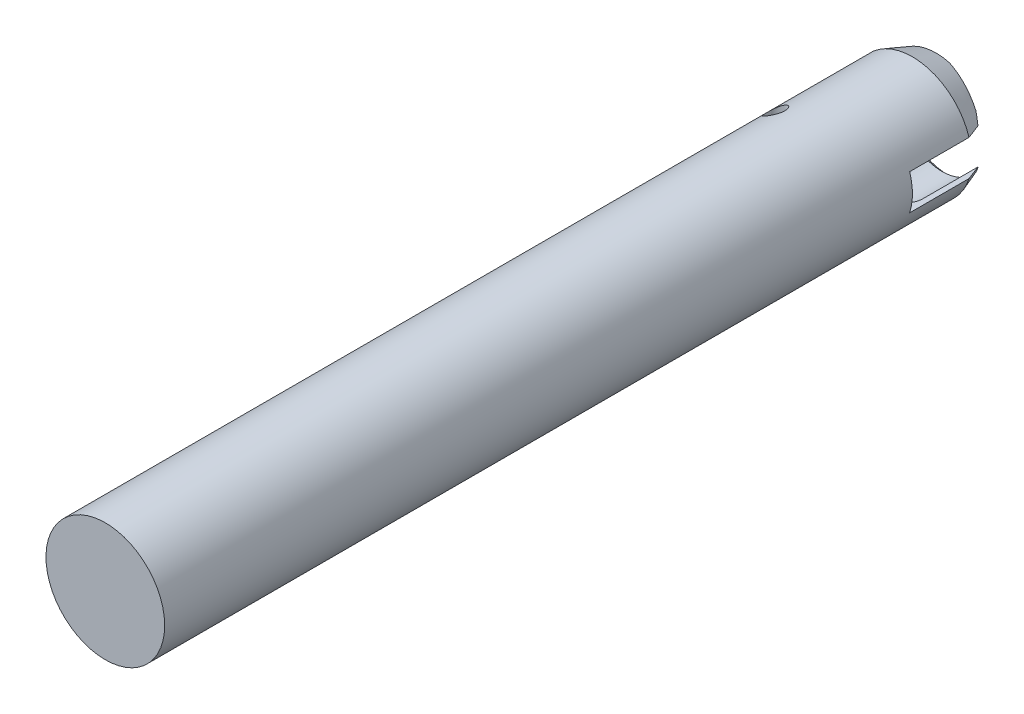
ISO-10303-21;
HEADER;
FILE_DESCRIPTION(('STEP AP214'),'2;1');
FILE_NAME('part.step','',(''),(''),'','','');
FILE_SCHEMA(('AUTOMOTIVE_DESIGN { 1 0 10303 214 1 1 1 1 }'));
ENDSEC;
DATA;
#1=APPLICATION_CONTEXT('core data for automotive mechanical design processes');
#2=APPLICATION_PROTOCOL_DEFINITION('international standard','automotive_design',2000,#1);
#3=PRODUCT_CONTEXT('',#1,'mechanical');
#4=PRODUCT('Part','Part','',(#3));
#5=PRODUCT_RELATED_PRODUCT_CATEGORY('part','',(#4));
#6=PRODUCT_DEFINITION_FORMATION('','',#4);
#7=PRODUCT_DEFINITION_CONTEXT('part definition',#1,'design');
#8=PRODUCT_DEFINITION('design','',#6,#7);
#9=PRODUCT_DEFINITION_SHAPE('','',#8);
#10=(LENGTH_UNIT() NAMED_UNIT(*) SI_UNIT(.MILLI.,.METRE.));
#11=(NAMED_UNIT(*) PLANE_ANGLE_UNIT() SI_UNIT($,.RADIAN.));
#12=(NAMED_UNIT(*) SI_UNIT($,.STERADIAN.) SOLID_ANGLE_UNIT());
#13=UNCERTAINTY_MEASURE_WITH_UNIT(LENGTH_MEASURE(1.E-05),#10,'distance_accuracy_value','');
#14=(GEOMETRIC_REPRESENTATION_CONTEXT(3) GLOBAL_UNCERTAINTY_ASSIGNED_CONTEXT((#13)) GLOBAL_UNIT_ASSIGNED_CONTEXT((#10,
#11,#12)) REPRESENTATION_CONTEXT('',''));
#15=CARTESIAN_POINT('',(0.,0.,0.));
#16=DIRECTION('',(0.,0.,1.));
#17=DIRECTION('',(1.,0.,0.));
#18=AXIS2_PLACEMENT_3D('',#15,#16,#17);
#19=CARTESIAN_POINT('',(0.,0.,35.));
#20=DIRECTION('',(0.,0.,-1.));
#21=DIRECTION('',(-1.,0.,0.));
#22=AXIS2_PLACEMENT_3D('',#19,#20,#21);
#23=CYLINDRICAL_SURFACE('',#22,2.5);
#24=CARTESIAN_POINT('',(-1.27,-2.15339267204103,5.896875));
#25=CARTESIAN_POINT('',(-1.24660588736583,-2.16718982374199,5.89687473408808));
#26=CARTESIAN_POINT('',(-1.22298240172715,-2.180604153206,5.89480587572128));
#27=CARTESIAN_POINT('',(-1.17591569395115,-2.20634101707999,5.88630187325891));
#28=CARTESIAN_POINT('',(-1.15247242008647,-2.21866387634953,5.87986803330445));
#29=CARTESIAN_POINT('',(-1.10643323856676,-2.24198016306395,5.86244258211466));
#30=CARTESIAN_POINT('',(-1.08384289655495,-2.25296564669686,5.85142530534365));
#31=CARTESIAN_POINT('',(-1.04063341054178,-2.27324694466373,5.82487279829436));
#32=CARTESIAN_POINT('',(-1.02001313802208,-2.28254372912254,5.80934017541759));
#33=CARTESIAN_POINT('',(-0.983828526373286,-2.29835389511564,5.7759638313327));
#34=CARTESIAN_POINT('',(-0.96795987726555,-2.30505794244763,5.75854018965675));
#35=CARTESIAN_POINT('',(-0.939371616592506,-2.31685579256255,5.72080271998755));
#36=CARTESIAN_POINT('',(-0.926650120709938,-2.32195055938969,5.70049063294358));
#37=CARTESIAN_POINT('',(-0.905965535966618,-2.33009424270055,5.65958031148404));
#38=CARTESIAN_POINT('',(-0.897675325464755,-2.33328689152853,5.6391754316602));
#39=CARTESIAN_POINT('',(-0.884562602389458,-2.33828971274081,5.59712036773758));
#40=CARTESIAN_POINT('',(-0.879739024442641,-2.34010030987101,5.57547056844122));
#41=CARTESIAN_POINT('',(-0.873899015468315,-2.34228729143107,5.5325797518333));
#42=CARTESIAN_POINT('',(-0.872722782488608,-2.34272388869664,5.51136338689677));
#43=CARTESIAN_POINT('',(-0.873769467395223,-2.34233372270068,5.46902760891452));
#44=CARTESIAN_POINT('',(-0.875991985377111,-2.34150710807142,5.44790818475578));
#45=CARTESIAN_POINT('',(-0.883701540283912,-2.33860813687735,5.40662385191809));
#46=CARTESIAN_POINT('',(-0.889149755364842,-2.33655059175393,5.38645062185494));
#47=CARTESIAN_POINT('',(-0.903068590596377,-2.33120619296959,5.34735084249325));
#48=CARTESIAN_POINT('',(-0.911539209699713,-2.32791933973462,5.32842429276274));
#49=CARTESIAN_POINT('',(-0.931312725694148,-2.32007988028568,5.29207114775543));
#50=CARTESIAN_POINT('',(-0.942651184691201,-2.3155112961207,5.27466738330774));
#51=CARTESIAN_POINT('',(-0.967680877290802,-2.30516305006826,5.24205490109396));
#52=CARTESIAN_POINT('',(-0.981372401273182,-2.29938323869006,5.22684645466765));
#53=CARTESIAN_POINT('',(-1.01123807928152,-2.2864104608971,5.19834533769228));
#54=CARTESIAN_POINT('',(-1.02749161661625,-2.2791688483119,5.18515820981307));
#55=CARTESIAN_POINT('',(-1.06147382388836,-2.26354216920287,5.16169028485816));
#56=CARTESIAN_POINT('',(-1.07920289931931,-2.25515678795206,5.15141029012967));
#57=CARTESIAN_POINT('',(-1.11701109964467,-2.23668541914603,5.1331509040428));
#58=CARTESIAN_POINT('',(-1.13716590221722,-2.22651803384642,5.12541121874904));
#59=CARTESIAN_POINT('',(-1.1779699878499,-2.20520237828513,5.11335609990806));
#60=CARTESIAN_POINT('',(-1.19861948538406,-2.1940536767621,5.10904218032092));
#61=CARTESIAN_POINT('',(-1.2422240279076,-2.16969353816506,5.1034221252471));
#62=CARTESIAN_POINT('',(-1.2651783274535,-2.15639091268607,5.10250687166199));
#63=CARTESIAN_POINT('',(-1.31051937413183,-2.12914071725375,5.1045462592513));
#64=CARTESIAN_POINT('',(-1.33290589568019,-2.11519289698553,5.10750241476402));
#65=CARTESIAN_POINT('',(-1.37927726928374,-2.08529181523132,5.1176433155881));
#66=CARTESIAN_POINT('',(-1.40313540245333,-2.06929738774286,5.12528931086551));
#67=CARTESIAN_POINT('',(-1.44908789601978,-2.03738281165,5.14494656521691));
#68=CARTESIAN_POINT('',(-1.47117969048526,-2.02146280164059,5.15696403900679));
#69=CARTESIAN_POINT('',(-1.51422230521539,-1.98944444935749,5.18602893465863));
#70=CARTESIAN_POINT('',(-1.53503936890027,-1.97338630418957,5.20332093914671));
#71=CARTESIAN_POINT('',(-1.57328389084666,-1.94303125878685,5.24256016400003));
#72=CARTESIAN_POINT('',(-1.59072036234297,-1.92872971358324,5.26449467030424));
#73=CARTESIAN_POINT('',(-1.61556156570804,-1.90791023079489,5.30397745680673));
#74=CARTESIAN_POINT('',(-1.62430319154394,-1.90045829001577,5.32019710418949));
#75=CARTESIAN_POINT('',(-1.6396243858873,-1.88725563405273,5.35427574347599));
#76=CARTESIAN_POINT('',(-1.64620609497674,-1.88150323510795,5.37213308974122));
#77=CARTESIAN_POINT('',(-1.65686419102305,-1.8721252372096,5.40931983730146));
#78=CARTESIAN_POINT('',(-1.66091706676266,-1.86851961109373,5.42866122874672));
#79=CARTESIAN_POINT('',(-1.66608193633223,-1.86391627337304,5.46803517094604));
#80=CARTESIAN_POINT('',(-1.66719668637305,-1.86291611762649,5.48806705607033));
#81=CARTESIAN_POINT('',(-1.66644606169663,-1.8635871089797,5.52525626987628));
#82=CARTESIAN_POINT('',(-1.66496951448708,-1.86490973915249,5.54242998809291));
#83=CARTESIAN_POINT('',(-1.65986660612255,-1.86945296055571,5.57619263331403));
#84=CARTESIAN_POINT('',(-1.65623995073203,-1.87267381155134,5.59278147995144));
#85=CARTESIAN_POINT('',(-1.64706059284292,-1.88075202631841,5.62495997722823));
#86=CARTESIAN_POINT('',(-1.64151053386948,-1.8856071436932,5.64055096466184));
#87=CARTESIAN_POINT('',(-1.62874240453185,-1.89664690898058,5.67052733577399));
#88=CARTESIAN_POINT('',(-1.62152328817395,-1.90283239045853,5.68491195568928));
#89=CARTESIAN_POINT('',(-1.60195644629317,-1.91936605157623,5.71875763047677));
#90=CARTESIAN_POINT('',(-1.58878749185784,-1.9303098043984,5.73745525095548));
#91=CARTESIAN_POINT('',(-1.56002175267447,-1.95363153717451,5.77184855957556));
#92=CARTESIAN_POINT('',(-1.54442086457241,-1.9660119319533,5.78753907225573));
#93=CARTESIAN_POINT('',(-1.51100433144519,-1.99181284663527,5.81609661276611));
#94=CARTESIAN_POINT('',(-1.49315711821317,-2.00524688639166,5.82891420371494));
#95=CARTESIAN_POINT('',(-1.45584112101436,-2.03250117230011,5.8513500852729));
#96=CARTESIAN_POINT('',(-1.43637257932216,-2.04632136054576,5.86096885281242));
#97=CARTESIAN_POINT('',(-1.39322228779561,-2.07598442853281,5.87807352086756));
#98=CARTESIAN_POINT('',(-1.36933855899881,-2.09183057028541,5.88504926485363));
#99=CARTESIAN_POINT('',(-1.32039290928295,-2.12306499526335,5.89445028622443));
#100=CARTESIAN_POINT('',(-1.29533091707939,-2.13845325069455,5.89687528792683));
#101=CARTESIAN_POINT('',(-1.27,-2.15339267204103,5.896875));
#102=B_SPLINE_CURVE_WITH_KNOTS('',3,(#24,#25,#26,#27,#28,#29,#30,#31,#32,#33,#34,#35,#36,#37,
#38,#39,#40,#41,#42,#43,#44,#45,#46,#47,#48,#49,#50,#51,#52,#53,#54,#55,#56,#57,#58,#59,#60,#61,
#62,#63,#64,#65,#66,#67,#68,#69,#70,#71,#72,#73,#74,#75,#76,#77,#78,#79,#80,#81,#82,#83,#84,#85,
#86,#87,#88,#89,#90,#91,#92,#93,#94,#95,#96,#97,#98,#99,#100,#101),.UNSPECIFIED.,.T.,.F.,(4,2,2,
2,2,2,2,2,2,2,2,2,2,2,2,2,2,2,2,2,2,2,2,2,2,2,2,2,2,2,2,2,2,2,2,2,2,2,4),(0.,0.0813907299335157,
0.162757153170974,0.24458546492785,0.326366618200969,0.399470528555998,0.472530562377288,
0.53895846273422,0.605365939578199,0.668819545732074,0.732265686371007,0.794963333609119,
0.857660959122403,0.921177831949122,0.984702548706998,1.05086044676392,1.11703658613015,
1.18833568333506,1.25966627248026,1.33898402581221,1.41833281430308,1.50712208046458,
1.59603807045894,1.68994765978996,1.7836033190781,1.84301527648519,1.90236817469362,
1.96226497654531,2.02210557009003,2.07371503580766,2.12533156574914,2.17687743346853,
2.22845569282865,2.30410248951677,2.37987833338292,2.4568721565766,2.53385449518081,
2.62197824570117,2.7101073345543),.UNSPECIFIED.);
#103=CARTESIAN_POINT('',(-1.27,-2.15339267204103,5.896875));
#104=VERTEX_POINT('',#103);
#105=EDGE_CURVE('E249',#104,#104,#102,.T.);
#106=ORIENTED_EDGE('',*,*,#105,.T.);
#107=EDGE_LOOP('',(#106));
#108=FACE_BOUND('',#107,.T.);
#109=CARTESIAN_POINT('',(-1.27,2.15339267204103,5.896875));
#110=CARTESIAN_POINT('',(-1.29909861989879,2.13622979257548,5.89687417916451));
#111=CARTESIAN_POINT('',(-1.32787722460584,2.11845313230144,5.89367067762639));
#112=CARTESIAN_POINT('',(-1.38382286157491,2.0823423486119,5.88128619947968));
#113=CARTESIAN_POINT('',(-1.41098517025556,2.06400680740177,5.87208855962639));
#114=CARTESIAN_POINT('',(-1.46051575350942,2.02921813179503,5.84912764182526));
#115=CARTESIAN_POINT('',(-1.48309546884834,2.01274420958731,5.83585025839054));
#116=CARTESIAN_POINT('',(-1.52559688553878,1.98072174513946,5.80474832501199));
#117=CARTESIAN_POINT('',(-1.54552365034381,1.96517147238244,5.78693263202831));
#118=CARTESIAN_POINT('',(-1.57716213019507,1.93980865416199,5.75211021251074));
#119=CARTESIAN_POINT('',(-1.58965526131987,1.92956357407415,5.73612614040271));
#120=CARTESIAN_POINT('',(-1.61236425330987,1.9106279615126,5.70178849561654));
#121=CARTESIAN_POINT('',(-1.62258337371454,1.90193520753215,5.68343837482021));
#122=CARTESIAN_POINT('',(-1.63855264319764,1.88818303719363,5.64825129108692));
#123=CARTESIAN_POINT('',(-1.6447819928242,1.88274766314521,5.63178031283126));
#124=CARTESIAN_POINT('',(-1.65507403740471,1.87370680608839,5.59769272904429));
#125=CARTESIAN_POINT('',(-1.65913837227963,1.87009993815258,5.58007700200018));
#126=CARTESIAN_POINT('',(-1.66484754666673,1.8650195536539,5.54404047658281));
#127=CARTESIAN_POINT('',(-1.6664782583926,1.86355849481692,5.52561561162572));
#128=CARTESIAN_POINT('',(-1.6671429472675,1.86296396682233,5.48868279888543));
#129=CARTESIAN_POINT('',(-1.66617754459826,1.86382994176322,5.47017487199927));
#130=CARTESIAN_POINT('',(-1.66193860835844,1.86760987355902,5.43540722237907));
#131=CARTESIAN_POINT('',(-1.65888635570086,1.87032741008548,5.41909767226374));
#132=CARTESIAN_POINT('',(-1.65089566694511,1.87738428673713,5.38731849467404));
#133=CARTESIAN_POINT('',(-1.64595643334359,1.88172431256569,5.37184922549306));
#134=CARTESIAN_POINT('',(-1.63261051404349,1.8933259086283,5.33731910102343));
#135=CARTESIAN_POINT('',(-1.62360205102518,1.90107692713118,5.31865546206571));
#136=CARTESIAN_POINT('',(-1.60324848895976,1.9182732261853,5.28350612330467));
#137=CARTESIAN_POINT('',(-1.59189897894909,1.92772170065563,5.26702463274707));
#138=CARTESIAN_POINT('',(-1.56391171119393,1.95053527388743,5.23213064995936));
#139=CARTESIAN_POINT('',(-1.54667805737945,1.96426281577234,5.21443403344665));
#140=CARTESIAN_POINT('',(-1.50979320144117,1.99275417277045,5.18282514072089));
#141=CARTESIAN_POINT('',(-1.49014042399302,2.00751866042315,5.16891534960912));
#142=CARTESIAN_POINT('',(-1.44865080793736,2.03766442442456,5.14478683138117));
#143=CARTESIAN_POINT('',(-1.42678929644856,2.05305116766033,5.13461747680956));
#144=CARTESIAN_POINT('',(-1.38155433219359,2.08375993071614,5.11836795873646));
#145=CARTESIAN_POINT('',(-1.35818078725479,2.09908194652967,5.11228804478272));
#146=CARTESIAN_POINT('',(-1.30807797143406,2.13070189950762,5.10406456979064));
#147=CARTESIAN_POINT('',(-1.28124307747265,2.14695040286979,5.10235987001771));
#148=CARTESIAN_POINT('',(-1.22712626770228,2.17833377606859,5.10452061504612));
#149=CARTESIAN_POINT('',(-1.19984441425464,2.19346879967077,5.10838528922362));
#150=CARTESIAN_POINT('',(-1.14775725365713,2.22113998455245,5.12153312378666));
#151=CARTESIAN_POINT('',(-1.12291106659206,2.23378345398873,5.13042348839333));
#152=CARTESIAN_POINT('',(-1.0748378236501,2.2573077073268,5.15340387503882));
#153=CARTESIAN_POINT('',(-1.05160900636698,2.26819042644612,5.1674881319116));
#154=CARTESIAN_POINT('',(-1.01087291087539,2.28660676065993,5.19845488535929));
#155=CARTESIAN_POINT('',(-0.99301488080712,2.29439253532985,5.21472667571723));
#156=CARTESIAN_POINT('',(-0.960287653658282,2.30828160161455,5.25064714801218));
#157=CARTESIAN_POINT('',(-0.945416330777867,2.31438609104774,5.27029340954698));
#158=CARTESIAN_POINT('',(-0.920795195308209,2.32428359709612,5.3101177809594));
#159=CARTESIAN_POINT('',(-0.910670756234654,2.32825244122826,5.33002151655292));
#160=CARTESIAN_POINT('',(-0.893857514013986,2.33475921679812,5.37144808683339));
#161=CARTESIAN_POINT('',(-0.887167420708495,2.33729768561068,5.39297031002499));
#162=CARTESIAN_POINT('',(-0.877785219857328,2.34083679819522,5.43573417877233));
#163=CARTESIAN_POINT('',(-0.874892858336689,2.34191457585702,5.45692576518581));
#164=CARTESIAN_POINT('',(-0.872552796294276,2.34278751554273,5.49952343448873));
#165=CARTESIAN_POINT('',(-0.873104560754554,2.34258287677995,5.5209294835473));
#166=CARTESIAN_POINT('',(-0.877587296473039,2.34090706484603,5.56292677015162));
#167=CARTESIAN_POINT('',(-0.881455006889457,2.33945960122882,5.58352575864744));
#168=CARTESIAN_POINT('',(-0.892334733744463,2.33533129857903,5.62374435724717));
#169=CARTESIAN_POINT('',(-0.899346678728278,2.33265048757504,5.64336398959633));
#170=CARTESIAN_POINT('',(-0.916306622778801,2.326040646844,5.68122951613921));
#171=CARTESIAN_POINT('',(-0.926274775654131,2.32210303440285,5.69946486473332));
#172=CARTESIAN_POINT('',(-0.94875276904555,2.31300987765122,5.73395259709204));
#173=CARTESIAN_POINT('',(-0.961262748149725,2.30785426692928,5.75020487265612));
#174=CARTESIAN_POINT('',(-0.988834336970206,2.29617891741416,5.78088276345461));
#175=CARTESIAN_POINT('',(-1.00396759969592,2.28961913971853,5.79522858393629));
#176=CARTESIAN_POINT('',(-1.03594213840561,2.27533083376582,5.82117128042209));
#177=CARTESIAN_POINT('',(-1.05278414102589,2.26760180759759,5.83276697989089));
#178=CARTESIAN_POINT('',(-1.08883486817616,2.2505249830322,5.85377039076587));
#179=CARTESIAN_POINT('',(-1.10812668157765,2.24110260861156,5.86297410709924));
#180=CARTESIAN_POINT('',(-1.14744204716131,2.22122970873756,5.87806429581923));
#181=CARTESIAN_POINT('',(-1.16746524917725,2.21077967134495,5.88395233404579));
#182=CARTESIAN_POINT('',(-1.20131534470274,2.19250667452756,5.89113837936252));
#183=CARTESIAN_POINT('',(-1.21508680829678,2.18490568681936,5.89330072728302));
#184=CARTESIAN_POINT('',(-1.24259571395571,2.16937917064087,5.89616928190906));
#185=CARTESIAN_POINT('',(-1.25633315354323,2.16145361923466,5.89687538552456));
#186=CARTESIAN_POINT('',(-1.27,2.15339267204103,5.896875));
#187=B_SPLINE_CURVE_WITH_KNOTS('',3,(#109,#110,#111,#112,#113,#114,#115,#116,#117,#118,#119,
#120,#121,#122,#123,#124,#125,#126,#127,#128,#129,#130,#131,#132,#133,#134,#135,#136,#137,#138,
#139,#140,#141,#142,#143,#144,#145,#146,#147,#148,#149,#150,#151,#152,#153,#154,#155,#156,#157,
#158,#159,#160,#161,#162,#163,#164,#165,#166,#167,#168,#169,#170,#171,#172,#173,#174,#175,#176,
#177,#178,#179,#180,#181,#182,#183,#184,#185,#186),.UNSPECIFIED.,.T.,.F.,(4,2,2,2,2,2,2,2,2,2,2,
2,2,2,2,2,2,2,2,2,2,2,2,2,2,2,2,2,2,2,2,2,2,2,2,2,2,2,4),(0.,0.101279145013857,
0.202841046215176,0.295254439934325,0.387488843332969,0.455432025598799,0.523277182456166,
0.578343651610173,0.633368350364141,0.68871125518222,0.744040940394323,0.79426334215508,
0.844506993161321,0.910525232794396,0.97666901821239,1.06100687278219,1.14539994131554,
1.23087007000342,1.31634541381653,1.41010901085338,1.50385963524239,1.59113326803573,
1.67831031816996,1.75403445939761,1.82970451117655,1.89739790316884,1.96506584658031,
2.02899955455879,2.09292333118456,2.15565405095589,2.21838334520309,2.28155052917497,
2.34472115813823,2.41001585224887,2.47533843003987,2.54513055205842,2.61488968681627,
2.66245443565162,2.71002255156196),.UNSPECIFIED.);
#188=CARTESIAN_POINT('',(-1.27,2.15339267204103,5.896875));
#189=VERTEX_POINT('',#188);
#190=EDGE_CURVE('E241',#189,#189,#187,.T.);
#191=ORIENTED_EDGE('',*,*,#190,.T.);
#192=EDGE_LOOP('',(#191));
#193=FACE_BOUND('',#192,.T.);
#194=CARTESIAN_POINT('',(0.,0.,35.));
#195=DIRECTION('',(0.,0.,1.));
#196=DIRECTION('',(1.,0.,0.));
#197=AXIS2_PLACEMENT_3D('',#194,#195,#196);
#198=CIRCLE('',#197,2.5);
#199=CARTESIAN_POINT('',(2.5,0.,35.));
#200=VERTEX_POINT('',#199);
#201=EDGE_CURVE('E501',#200,#200,#198,.T.);
#202=ORIENTED_EDGE('',*,*,#201,.F.);
#203=EDGE_LOOP('',(#202));
#204=FACE_BOUND('',#203,.T.);
#205=CARTESIAN_POINT('',(0.,0.,6.5));
#206=DIRECTION('',(0.,0.,1.));
#207=DIRECTION('',(1.,0.,0.));
#208=AXIS2_PLACEMENT_3D('',#205,#206,#207);
#209=CIRCLE('',#208,2.5);
#210=CARTESIAN_POINT('',(-2.43874967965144,-0.55,6.5));
#211=VERTEX_POINT('',#210);
#212=CARTESIAN_POINT('',(-2.26881026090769,-1.05,6.5));
#213=VERTEX_POINT('',#212);
#214=EDGE_CURVE('E229',#211,#213,#209,.T.);
#215=ORIENTED_EDGE('',*,*,#214,.F.);
#216=DIRECTION('',(0.,0.,-1.));
#217=VECTOR('',#216,1.);
#218=CARTESIAN_POINT('',(-2.43874967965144,-0.55,35.));
#219=LINE('',#218,#217);
#220=CARTESIAN_POINT('',(-2.43874967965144,-0.55,1.00000000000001));
#221=VERTEX_POINT('',#220);
#222=EDGE_CURVE('E333',#211,#221,#219,.T.);
#223=ORIENTED_EDGE('',*,*,#222,.T.);
#224=CARTESIAN_POINT('',(0.,0.,1.00000000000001));
#225=DIRECTION('',(0.,0.,1.));
#226=DIRECTION('',(1.,0.,0.));
#227=AXIS2_PLACEMENT_3D('',#224,#225,#226);
#228=CIRCLE('',#227,2.5);
#229=CARTESIAN_POINT('',(2.38484800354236,-0.75,1.00000000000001));
#230=VERTEX_POINT('',#229);
#231=EDGE_CURVE('E425',#221,#230,#228,.T.);
#232=ORIENTED_EDGE('',*,*,#231,.T.);
#233=DIRECTION('',(0.,0.,-1.));
#234=VECTOR('',#233,1.);
#235=CARTESIAN_POINT('',(2.38484800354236,-0.75,35.));
#236=LINE('',#235,#234);
#237=CARTESIAN_POINT('',(2.38484800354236,-0.75,3.5));
#238=VERTEX_POINT('',#237);
#239=EDGE_CURVE('E387',#230,#238,#236,.F.);
#240=ORIENTED_EDGE('',*,*,#239,.T.);
#241=CARTESIAN_POINT('',(0.,0.,3.5));
#242=DIRECTION('',(0.,0.,-1.));
#243=DIRECTION('',(-1.,0.,0.));
#244=AXIS2_PLACEMENT_3D('',#241,#242,#243);
#245=CIRCLE('',#244,2.5);
#246=CARTESIAN_POINT('',(2.38484800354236,0.75,3.5));
#247=VERTEX_POINT('',#246);
#248=EDGE_CURVE('E396',#247,#238,#245,.T.);
#249=ORIENTED_EDGE('',*,*,#248,.F.);
#250=DIRECTION('',(0.,0.,-1.));
#251=VECTOR('',#250,1.);
#252=CARTESIAN_POINT('',(2.38484800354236,0.75,35.));
#253=LINE('',#252,#251);
#254=CARTESIAN_POINT('',(2.38484800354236,0.75,1.00000000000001));
#255=VERTEX_POINT('',#254);
#256=EDGE_CURVE('E393',#247,#255,#253,.T.);
#257=ORIENTED_EDGE('',*,*,#256,.T.);
#258=CARTESIAN_POINT('',(-2.43874967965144,0.55,1.00000000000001));
#259=VERTEX_POINT('',#258);
#260=EDGE_CURVE('E500',#255,#259,#228,.T.);
#261=ORIENTED_EDGE('',*,*,#260,.T.);
#262=DIRECTION('',(0.,0.,-1.));
#263=VECTOR('',#262,1.);
#264=CARTESIAN_POINT('',(-2.43874967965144,0.55,35.));
#265=LINE('',#264,#263);
#266=CARTESIAN_POINT('',(-2.43874967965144,0.55,6.5));
#267=VERTEX_POINT('',#266);
#268=EDGE_CURVE('E332',#259,#267,#265,.F.);
#269=ORIENTED_EDGE('',*,*,#268,.T.);
#270=CARTESIAN_POINT('',(-2.26881026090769,1.05,6.5));
#271=VERTEX_POINT('',#270);
#272=EDGE_CURVE('E232',#271,#267,#209,.T.);
#273=ORIENTED_EDGE('',*,*,#272,.F.);
#274=DIRECTION('',(0.,0.,-1.));
#275=VECTOR('',#274,1.);
#276=CARTESIAN_POINT('',(-2.26881026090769,1.05,35.));
#277=LINE('',#276,#275);
#278=CARTESIAN_POINT('',(-2.26881026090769,1.05,30.));
#279=VERTEX_POINT('',#278);
#280=EDGE_CURVE('E47',#279,#271,#277,.T.);
#281=ORIENTED_EDGE('',*,*,#280,.F.);
#282=CARTESIAN_POINT('',(0.,0.,30.));
#283=DIRECTION('',(0.,0.,-1.));
#284=DIRECTION('',(-1.,0.,0.));
#285=AXIS2_PLACEMENT_3D('',#282,#283,#284);
#286=CIRCLE('',#285,2.5);
#287=CARTESIAN_POINT('',(-2.26881026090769,-1.05,30.));
#288=VERTEX_POINT('',#287);
#289=EDGE_CURVE('E437',#288,#279,#286,.T.);
#290=ORIENTED_EDGE('',*,*,#289,.F.);
#291=DIRECTION('',(0.,0.,-1.));
#292=VECTOR('',#291,1.);
#293=CARTESIAN_POINT('',(-2.26881026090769,-1.05,35.));
#294=LINE('',#293,#292);
#295=EDGE_CURVE('E12',#213,#288,#294,.F.);
#296=ORIENTED_EDGE('',*,*,#295,.F.);
#297=EDGE_LOOP('',(#215,#223,#232,#240,#249,#257,#261,#269,#273,#281,#290,#296));
#298=FACE_BOUND('',#297,.T.);
#299=ADVANCED_FACE('F38',(#108,#193,#204,#298),#23,.T.);
#300=CARTESIAN_POINT('',(-2.72703684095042,0.55,30.));
#301=DIRECTION('',(0.,1.,0.));
#302=DIRECTION('',(0.,0.,1.));
#303=AXIS2_PLACEMENT_3D('',#300,#301,#302);
#304=PLANE('',#303);
#305=DIRECTION('',(1.,0.,0.));
#306=VECTOR('',#305,1.);
#307=CARTESIAN_POINT('',(-2.72703684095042,0.55,6.5));
#308=LINE('',#307,#306);
#309=CARTESIAN_POINT('',(-1.22703684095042,0.55,6.5));
#310=VERTEX_POINT('',#309);
#311=EDGE_CURVE('E231',#267,#310,#308,.T.);
#312=ORIENTED_EDGE('',*,*,#311,.F.);
#313=ORIENTED_EDGE('',*,*,#268,.F.);
#314=CARTESIAN_POINT('',(-3.03990481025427,0.55,2.61897583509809));
#315=CARTESIAN_POINT('',(-2.90897009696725,0.55,2.26509451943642));
#316=CARTESIAN_POINT('',(-2.77786600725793,0.55,1.91127480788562));
#317=CARTESIAN_POINT('',(-2.51493068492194,0.55,1.20391154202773));
#318=CARTESIAN_POINT('',(-2.3830994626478,0.55,0.850367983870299));
#319=CARTESIAN_POINT('',(-2.18451225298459,0.55,0.320364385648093));
#320=CARTESIAN_POINT('',(-2.11817597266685,0.55,0.14374720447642));
#321=CARTESIAN_POINT('',(-1.98512392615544,0.55,-0.209343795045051));
#322=CARTESIAN_POINT('',(-1.91840816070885,0.55,-0.385817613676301));
#323=CARTESIAN_POINT('',(-1.78447266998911,0.55,-0.738577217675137));
#324=CARTESIAN_POINT('',(-1.71725293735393,0.55,-0.91486300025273));
#325=CARTESIAN_POINT('',(-1.58207777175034,0.55,-1.26715346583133));
#326=CARTESIAN_POINT('',(-1.51412233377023,0.55,-1.44315814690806));
#327=CARTESIAN_POINT('',(-1.44568314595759,0.55,-1.61897583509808));
#328=B_SPLINE_CURVE_WITH_KNOTS('',3,(#314,#315,#316,#317,#318,#319,#320,#321,#322,#323,#324,
#325,#326,#327),.UNSPECIFIED.,.F.,.F.,(4,2,2,2,2,2,4),(0.,1.13198346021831,2.263950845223,
2.82994269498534,3.39593343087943,3.96193245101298,4.52793532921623),.UNSPECIFIED.);
#329=CARTESIAN_POINT('',(-2.06400657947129,0.55,0.));
#330=VERTEX_POINT('',#329);
#331=EDGE_CURVE('E325',#259,#330,#328,.T.);
#332=ORIENTED_EDGE('',*,*,#331,.T.);
#333=DIRECTION('',(1.,0.,0.));
#334=VECTOR('',#333,1.);
#335=CARTESIAN_POINT('',(-2.72703684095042,0.55,0.));
#336=LINE('',#335,#334);
#337=CARTESIAN_POINT('',(-1.48781444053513,0.55,0.));
#338=VERTEX_POINT('',#337);
#339=EDGE_CURVE('E400',#330,#338,#336,.T.);
#340=ORIENTED_EDGE('',*,*,#339,.T.);
#341=CARTESIAN_POINT('',(-2.00654879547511,0.55,-0.503681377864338));
#342=CARTESIAN_POINT('',(-1.90077387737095,0.55,-0.400400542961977));
#343=CARTESIAN_POINT('',(-1.79488213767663,0.55,-0.297237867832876));
#344=CARTESIAN_POINT('',(-1.58265170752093,0.55,-0.0913862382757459));
#345=CARTESIAN_POINT('',(-1.47631304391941,0.55,0.0113027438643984));
#346=CARTESIAN_POINT('',(-1.26295758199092,0.55,0.215987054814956));
#347=CARTESIAN_POINT('',(-1.15594074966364,0.55,0.317982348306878));
#348=CARTESIAN_POINT('',(-0.994549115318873,0.55,0.470063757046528));
#349=CARTESIAN_POINT('',(-0.940605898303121,0.55,0.52060711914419));
#350=CARTESIAN_POINT('',(-0.832313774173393,0.55,0.621259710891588));
#351=CARTESIAN_POINT('',(-0.777964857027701,0.55,0.671368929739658));
#352=CARTESIAN_POINT('',(-0.72335546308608,0.55,0.721195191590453));
#353=B_SPLINE_CURVE_WITH_KNOTS('',3,(#341,#342,#343,#344,#345,#346,#347,#348,#349,#350,#351,
#352),.UNSPECIFIED.,.F.,.F.,(4,2,2,2,2,4),(0.,0.443507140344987,0.886987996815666,
1.3304912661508,1.5522560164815,1.77402626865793),.UNSPECIFIED.);
#354=CARTESIAN_POINT('',(-1.22703684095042,0.55,0.249999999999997));
#355=VERTEX_POINT('',#354);
#356=EDGE_CURVE('E316',#338,#355,#353,.T.);
#357=ORIENTED_EDGE('',*,*,#356,.T.);
#358=DIRECTION('',(0.,0.,-1.));
#359=VECTOR('',#358,1.);
#360=CARTESIAN_POINT('',(-1.22703684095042,0.55,30.));
#361=LINE('',#360,#359);
#362=CARTESIAN_POINT('',(-1.22703684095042,0.55,2.70625));
#363=VERTEX_POINT('',#362);
#364=EDGE_CURVE('E406',#363,#355,#361,.T.);
#365=ORIENTED_EDGE('',*,*,#364,.F.);
#366=CARTESIAN_POINT('',(-1.22703684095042,0.55,2.70625));
#367=CARTESIAN_POINT('',(-1.22707931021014,0.55,2.74916532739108));
#368=CARTESIAN_POINT('',(-1.22338704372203,0.55,2.7920624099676));
#369=CARTESIAN_POINT('',(-1.20885505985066,0.55,2.87655311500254));
#370=CARTESIAN_POINT('',(-1.19802797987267,0.55,2.91814890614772));
#371=CARTESIAN_POINT('',(-1.16954343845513,0.55,2.99893830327));
#372=CARTESIAN_POINT('',(-1.15188458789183,0.55,3.03813141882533));
#373=CARTESIAN_POINT('',(-1.11031985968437,0.55,3.11305191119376));
#374=CARTESIAN_POINT('',(-1.08641295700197,0.55,3.14877871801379));
#375=CARTESIAN_POINT('',(-1.03274868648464,0.55,3.21629942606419));
#376=CARTESIAN_POINT('',(-1.00291815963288,0.55,3.24803509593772));
#377=CARTESIAN_POINT('',(-0.938551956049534,0.55,3.30627078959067));
#378=CARTESIAN_POINT('',(-0.904017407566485,0.55,3.3327720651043));
#379=CARTESIAN_POINT('',(-0.829750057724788,0.55,3.38102636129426));
#380=CARTESIAN_POINT('',(-0.789862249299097,0.55,3.4025403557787));
#381=CARTESIAN_POINT('',(-0.707190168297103,0.55,3.43913206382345));
#382=CARTESIAN_POINT('',(-0.664401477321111,0.55,3.45419969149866));
#383=CARTESIAN_POINT('',(-0.573583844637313,0.55,3.47884015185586));
#384=CARTESIAN_POINT('',(-0.525409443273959,0.55,3.48787739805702));
#385=CARTESIAN_POINT('',(-0.4526833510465,0.55,3.4961201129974));
#386=CARTESIAN_POINT('',(-0.4283932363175,0.55,3.4979830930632));
#387=CARTESIAN_POINT('',(-0.379760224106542,0.55,3.5000518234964));
#388=CARTESIAN_POINT('',(-0.355417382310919,0.55,3.50025886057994));
#389=CARTESIAN_POINT('',(-0.331089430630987,0.55,3.49969085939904));
#390=B_SPLINE_CURVE_WITH_KNOTS('',3,(#366,#367,#368,#369,#370,#371,#372,#373,#374,#375,#376,
#377,#378,#379,#380,#381,#382,#383,#384,#385,#386,#387,#388,#389),.UNSPECIFIED.,.F.,.F.,(4,2,2,
2,2,2,2,2,2,2,2,4),(0.,0.128559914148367,0.256892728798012,0.385251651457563,0.513631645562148,
0.643708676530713,0.773754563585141,0.909128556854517,1.04471358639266,1.19113804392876,
1.26417575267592,1.33715670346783),.UNSPECIFIED.);
#391=CARTESIAN_POINT('',(-0.357526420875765,0.55,3.5));
#392=VERTEX_POINT('',#391);
#393=EDGE_CURVE('E292',#363,#392,#390,.T.);
#394=ORIENTED_EDGE('',*,*,#393,.T.);
#395=DIRECTION('',(1.,0.,0.));
#396=VECTOR('',#395,1.);
#397=CARTESIAN_POINT('',(0.5,0.55,3.5));
#398=LINE('',#397,#396);
#399=CARTESIAN_POINT('',(-1.22703684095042,0.55,3.5));
#400=VERTEX_POINT('',#399);
#401=EDGE_CURVE('E54',#400,#392,#398,.T.);
#402=ORIENTED_EDGE('',*,*,#401,.F.);
#403=CARTESIAN_POINT('',(-1.22703684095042,0.55,5.1054573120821));
#404=VERTEX_POINT('',#403);
#405=EDGE_CURVE('E413',#404,#400,#361,.T.);
#406=ORIENTED_EDGE('',*,*,#405,.F.);
#407=CARTESIAN_POINT('',(-1.27,0.55,5.5));
#408=DIRECTION('',(0.,1.,0.));
#409=DIRECTION('',(0.,0.,1.));
#410=AXIS2_PLACEMENT_3D('',#407,#408,#409);
#411=CIRCLE('',#410,0.396875);
#412=CARTESIAN_POINT('',(-1.22703684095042,0.55,5.8945426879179));
#413=VERTEX_POINT('',#412);
#414=EDGE_CURVE('E238',#404,#413,#411,.T.);
#415=ORIENTED_EDGE('',*,*,#414,.T.);
#416=EDGE_CURVE('E412',#310,#413,#361,.T.);
#417=ORIENTED_EDGE('',*,*,#416,.F.);
#418=EDGE_LOOP('',(#312,#313,#332,#340,#357,#365,#394,#402,#406,#415,#417));
#419=FACE_BOUND('',#418,.T.);
#420=ADVANCED_FACE('F304',(#419),#304,.F.);
#421=CARTESIAN_POINT('',(-1.22703684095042,-0.55,30.));
#422=DIRECTION('',(0.,-1.,0.));
#423=DIRECTION('',(0.,0.,-1.));
#424=AXIS2_PLACEMENT_3D('',#421,#422,#423);
#425=PLANE('',#424);
#426=DIRECTION('',(-1.,0.,0.));
#427=VECTOR('',#426,1.);
#428=CARTESIAN_POINT('',(-1.22703684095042,-0.55,6.5));
#429=LINE('',#428,#427);
#430=CARTESIAN_POINT('',(-1.22703684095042,-0.55,6.5));
#431=VERTEX_POINT('',#430);
#432=EDGE_CURVE('E227',#431,#211,#429,.T.);
#433=ORIENTED_EDGE('',*,*,#432,.F.);
#434=DIRECTION('',(0.,0.,-1.));
#435=VECTOR('',#434,1.);
#436=CARTESIAN_POINT('',(-1.22703684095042,-0.55,30.));
#437=LINE('',#436,#435);
#438=CARTESIAN_POINT('',(-1.22703684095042,-0.55,5.8945426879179));
#439=VERTEX_POINT('',#438);
#440=EDGE_CURVE('E407',#431,#439,#437,.T.);
#441=ORIENTED_EDGE('',*,*,#440,.T.);
#442=CARTESIAN_POINT('',(-1.27,-0.55,5.5));
#443=DIRECTION('',(0.,-1.,0.));
#444=DIRECTION('',(0.,0.,-1.));
#445=AXIS2_PLACEMENT_3D('',#442,#443,#444);
#446=CIRCLE('',#445,0.396875);
#447=CARTESIAN_POINT('',(-1.22703684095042,-0.55,5.1054573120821));
#448=VERTEX_POINT('',#447);
#449=EDGE_CURVE('E235',#439,#448,#446,.T.);
#450=ORIENTED_EDGE('',*,*,#449,.T.);
#451=CARTESIAN_POINT('',(-1.22703684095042,-0.55,3.5));
#452=VERTEX_POINT('',#451);
#453=EDGE_CURVE('E410',#448,#452,#437,.T.);
#454=ORIENTED_EDGE('',*,*,#453,.T.);
#455=DIRECTION('',(-1.,0.,0.));
#456=VECTOR('',#455,1.);
#457=CARTESIAN_POINT('',(0.5,-0.55,3.5));
#458=LINE('',#457,#456);
#459=CARTESIAN_POINT('',(-0.357526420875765,-0.55,3.5));
#460=VERTEX_POINT('',#459);
#461=EDGE_CURVE('E449',#460,#452,#458,.T.);
#462=ORIENTED_EDGE('',*,*,#461,.F.);
#463=CARTESIAN_POINT('',(-1.22703684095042,-0.55,2.70625));
#464=CARTESIAN_POINT('',(-1.22707931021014,-0.55,2.74916532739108));
#465=CARTESIAN_POINT('',(-1.22338704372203,-0.55,2.7920624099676));
#466=CARTESIAN_POINT('',(-1.20885505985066,-0.55,2.87655311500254));
#467=CARTESIAN_POINT('',(-1.19802797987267,-0.55,2.91814890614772));
#468=CARTESIAN_POINT('',(-1.16954343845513,-0.55,2.99893830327));
#469=CARTESIAN_POINT('',(-1.15188458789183,-0.55,3.03813141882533));
#470=CARTESIAN_POINT('',(-1.11031985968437,-0.55,3.11305191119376));
#471=CARTESIAN_POINT('',(-1.08641295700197,-0.55,3.14877871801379));
#472=CARTESIAN_POINT('',(-1.03274868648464,-0.55,3.21629942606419));
#473=CARTESIAN_POINT('',(-1.00291815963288,-0.55,3.24803509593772));
#474=CARTESIAN_POINT('',(-0.938551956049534,-0.55,3.30627078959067));
#475=CARTESIAN_POINT('',(-0.904017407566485,-0.55,3.33277206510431));
#476=CARTESIAN_POINT('',(-0.829750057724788,-0.55,3.38102636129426));
#477=CARTESIAN_POINT('',(-0.789862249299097,-0.55,3.4025403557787));
#478=CARTESIAN_POINT('',(-0.707190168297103,-0.55,3.43913206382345));
#479=CARTESIAN_POINT('',(-0.664401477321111,-0.55,3.45419969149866));
#480=CARTESIAN_POINT('',(-0.573583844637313,-0.55,3.47884015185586));
#481=CARTESIAN_POINT('',(-0.525409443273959,-0.55,3.48787739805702));
#482=CARTESIAN_POINT('',(-0.4526833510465,-0.55,3.4961201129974));
#483=CARTESIAN_POINT('',(-0.4283932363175,-0.55,3.4979830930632));
#484=CARTESIAN_POINT('',(-0.379760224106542,-0.55,3.5000518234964));
#485=CARTESIAN_POINT('',(-0.355417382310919,-0.55,3.50025886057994));
#486=CARTESIAN_POINT('',(-0.331089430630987,-0.55,3.49969085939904));
#487=B_SPLINE_CURVE_WITH_KNOTS('',3,(#463,#464,#465,#466,#467,#468,#469,#470,#471,#472,#473,
#474,#475,#476,#477,#478,#479,#480,#481,#482,#483,#484,#485,#486),.UNSPECIFIED.,.F.,.F.,(4,2,2,
2,2,2,2,2,2,2,2,4),(0.,0.128559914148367,0.256892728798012,0.385251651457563,0.513631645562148,
0.643708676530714,0.773754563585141,0.909128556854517,1.04471358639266,1.19113804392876,
1.26417575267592,1.33715670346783),.UNSPECIFIED.);
#488=CARTESIAN_POINT('',(-1.22703684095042,-0.55,2.70625));
#489=VERTEX_POINT('',#488);
#490=EDGE_CURVE('E453',#460,#489,#487,.F.);
#491=ORIENTED_EDGE('',*,*,#490,.T.);
#492=CARTESIAN_POINT('',(-1.22703684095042,-0.55,0.249999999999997));
#493=VERTEX_POINT('',#492);
#494=EDGE_CURVE('E411',#489,#493,#437,.T.);
#495=ORIENTED_EDGE('',*,*,#494,.T.);
#496=CARTESIAN_POINT('',(-0.72335546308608,-0.55,0.721195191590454));
#497=CARTESIAN_POINT('',(-0.77174401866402,-0.55,0.677049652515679));
#498=CARTESIAN_POINT('',(-0.819925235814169,-0.55,0.632678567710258));
#499=CARTESIAN_POINT('',(-0.91595822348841,-0.55,0.543583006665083));
#500=CARTESIAN_POINT('',(-0.963810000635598,-0.55,0.498858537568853));
#501=CARTESIAN_POINT('',(-1.10699758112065,-0.55,0.364302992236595));
#502=CARTESIAN_POINT('',(-1.20197002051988,-0.55,0.274085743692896));
#503=CARTESIAN_POINT('',(-1.39131038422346,-0.55,0.0930339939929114));
#504=CARTESIAN_POINT('',(-1.48567834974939,-0.55,0.00219953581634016));
#505=CARTESIAN_POINT('',(-1.67401758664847,-0.55,-0.179881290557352));
#506=CARTESIAN_POINT('',(-1.76798885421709,-0.55,-0.271127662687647));
#507=CARTESIAN_POINT('',(-1.88596026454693,-0.55,-0.386025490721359));
#508=CARTESIAN_POINT('',(-1.91008961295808,-0.55,-0.409544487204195));
#509=CARTESIAN_POINT('',(-1.9583315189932,-0.55,-0.456600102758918));
#510=CARTESIAN_POINT('',(-1.98244407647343,-0.55,-0.480136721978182));
#511=CARTESIAN_POINT('',(-2.00654879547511,-0.55,-0.503681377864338));
#512=B_SPLINE_CURVE_WITH_KNOTS('',3,(#496,#497,#498,#499,#500,#501,#502,#503,#504,#505,#506,
#507,#508,#509,#510,#511),.UNSPECIFIED.,.F.,.F.,(4,2,2,2,2,2,2,4),(0.,0.196498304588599,
0.392992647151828,0.785963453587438,1.17890717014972,1.5718546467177,1.67294034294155,
1.774026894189),.UNSPECIFIED.);
#513=CARTESIAN_POINT('',(-1.48781444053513,-0.55,0.));
#514=VERTEX_POINT('',#513);
#515=EDGE_CURVE('E465',#493,#514,#512,.T.);
#516=ORIENTED_EDGE('',*,*,#515,.T.);
#517=DIRECTION('',(-1.,0.,0.));
#518=VECTOR('',#517,1.);
#519=CARTESIAN_POINT('',(-1.22703684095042,-0.55,0.));
#520=LINE('',#519,#518);
#521=CARTESIAN_POINT('',(-2.06400657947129,-0.55,0.));
#522=VERTEX_POINT('',#521);
#523=EDGE_CURVE('E404',#514,#522,#520,.T.);
#524=ORIENTED_EDGE('',*,*,#523,.T.);
#525=CARTESIAN_POINT('',(-1.44568314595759,-0.55,-1.61897583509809));
#526=CARTESIAN_POINT('',(-1.5153679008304,-0.55,-1.43995503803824));
#527=CARTESIAN_POINT('',(-1.58455256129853,-0.55,-1.26074096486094));
#528=CARTESIAN_POINT('',(-1.72216376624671,-0.55,-0.902023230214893));
#529=CARTESIAN_POINT('',(-1.79059031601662,-0.55,-0.722519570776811));
#530=CARTESIAN_POINT('',(-1.9269273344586,-0.55,-0.363319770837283));
#531=CARTESIAN_POINT('',(-1.9948378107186,-0.55,-0.18362363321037));
#532=CARTESIAN_POINT('',(-2.13027160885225,-0.55,0.175914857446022));
#533=CARTESIAN_POINT('',(-2.19779492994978,-0.55,0.3557572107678));
#534=CARTESIAN_POINT('',(-2.39511387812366,-0.55,0.882566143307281));
#535=CARTESIAN_POINT('',(-2.52452212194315,-0.55,1.22967771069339));
#536=CARTESIAN_POINT('',(-2.78264402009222,-0.55,1.92416458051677));
#537=CARTESIAN_POINT('',(-2.91135766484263,-0.55,2.27153988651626));
#538=CARTESIAN_POINT('',(-3.03990481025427,-0.55,2.61897583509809));
#539=B_SPLINE_CURVE_WITH_KNOTS('',3,(#525,#526,#527,#528,#529,#530,#531,#532,#533,#534,#535,
#536,#537,#538),.UNSPECIFIED.,.F.,.F.,(4,2,2,2,2,2,4),(0.,0.576313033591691,1.15262204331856,
1.72892256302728,2.30522423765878,3.41657213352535,4.52793531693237),.UNSPECIFIED.);
#540=EDGE_CURVE('E372',#522,#221,#539,.T.);
#541=ORIENTED_EDGE('',*,*,#540,.T.);
#542=ORIENTED_EDGE('',*,*,#222,.F.);
#543=EDGE_LOOP('',(#433,#441,#450,#454,#462,#491,#495,#516,#524,#541,#542));
#544=FACE_BOUND('',#543,.T.);
#545=ADVANCED_FACE('F309',(#544),#425,.F.);
#546=CARTESIAN_POINT('',(-1.22703684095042,0.55,30.));
#547=DIRECTION('',(1.,0.,0.));
#548=DIRECTION('',(0.,0.,-1.));
#549=AXIS2_PLACEMENT_3D('',#546,#547,#548);
#550=PLANE('',#549);
#551=ORIENTED_EDGE('',*,*,#453,.F.);
#552=DIRECTION('',(0.,1.,0.));
#553=VECTOR('',#552,1.);
#554=CARTESIAN_POINT('',(-1.22703684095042,-2.5,5.1054573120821));
#555=LINE('',#554,#553);
#556=EDGE_CURVE('E436',#448,#404,#555,.T.);
#557=ORIENTED_EDGE('',*,*,#556,.T.);
#558=ORIENTED_EDGE('',*,*,#405,.T.);
#559=DIRECTION('',(0.,-1.,0.));
#560=VECTOR('',#559,1.);
#561=CARTESIAN_POINT('',(-1.22703684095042,0.,3.5));
#562=LINE('',#561,#560);
#563=EDGE_CURVE('E409',#400,#452,#562,.T.);
#564=ORIENTED_EDGE('',*,*,#563,.T.);
#565=EDGE_LOOP('',(#551,#557,#558,#564));
#566=FACE_BOUND('',#565,.T.);
#567=ADVANCED_FACE('F461',(#566),#550,.F.);
#568=CARTESIAN_POINT('',(0.,0.,1.00000000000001));
#569=DIRECTION('',(0.,0.,1.));
#570=DIRECTION('',(1.,0.,0.));
#571=AXIS2_PLACEMENT_3D('',#568,#569,#570);
#572=CONICAL_SURFACE('',#571,2.5,0.349065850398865);
#573=CARTESIAN_POINT('',(1.39776446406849,0.75,-1.51045861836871));
#574=CARTESIAN_POINT('',(1.43537183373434,0.75,-1.41939849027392));
#575=CARTESIAN_POINT('',(1.47269901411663,0.75,-1.32822334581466));
#576=CARTESIAN_POINT('',(1.54688620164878,0.75,-1.14568400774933));
#577=CARTESIAN_POINT('',(1.58374621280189,0.75,-1.05431981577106));
#578=CARTESIAN_POINT('',(1.69376429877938,0.75,-0.78000767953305));
#579=CARTESIAN_POINT('',(1.76636242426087,0.75,-0.596835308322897));
#580=CARTESIAN_POINT('',(1.91052284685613,0.75,-0.23009606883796));
#581=CARTESIAN_POINT('',(1.98208520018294,0.75,-0.0465292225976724));
#582=CARTESIAN_POINT('',(2.12445788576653,0.75,0.320897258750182));
#583=CARTESIAN_POINT('',(2.19526821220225,0.75,0.504756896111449));
#584=CARTESIAN_POINT('',(2.38203659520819,0.75,0.99188683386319));
#585=CARTESIAN_POINT('',(2.49751965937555,0.75,1.29533903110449));
#586=CARTESIAN_POINT('',(2.72746200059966,0.75,1.9026463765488));
#587=CARTESIAN_POINT('',(2.84192123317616,0.75,2.20650154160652));
#588=CARTESIAN_POINT('',(2.9561035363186,0.75,2.5104586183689));
#589=B_SPLINE_CURVE_WITH_KNOTS('',3,(#573,#574,#575,#576,#577,#578,#579,#580,#581,#582,#583,
#584,#585,#586,#587,#588),.UNSPECIFIED.,.F.,.F.,(4,2,2,2,2,2,2,4),(0.,0.295559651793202,
0.591116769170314,1.18221522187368,1.77328147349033,2.36435229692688,3.3384012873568,
4.31249239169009),.UNSPECIFIED.);
#590=CARTESIAN_POINT('',(2.15004734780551,0.75,0.387598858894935));
#591=VERTEX_POINT('',#590);
#592=EDGE_CURVE('E277',#591,#255,#589,.T.);
#593=ORIENTED_EDGE('',*,*,#592,.F.);
#594=CARTESIAN_POINT('',(1.2039302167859,1.67022109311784,-0.211900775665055));
#595=CARTESIAN_POINT('',(1.25949748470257,1.64680080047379,-0.174822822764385));
#596=CARTESIAN_POINT('',(1.31437113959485,1.62040693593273,-0.138577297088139));
#597=CARTESIAN_POINT('',(1.42232761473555,1.56149540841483,-0.0679045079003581));
#598=CARTESIAN_POINT('',(1.47540251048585,1.52895398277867,-0.0334849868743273));
#599=CARTESIAN_POINT('',(1.60691386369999,1.43849101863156,0.0510959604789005));
#600=CARTESIAN_POINT('',(1.68353325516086,1.37636421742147,0.0996973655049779));
#601=CARTESIAN_POINT('',(1.82754847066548,1.23803697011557,0.190086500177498));
#602=CARTESIAN_POINT('',(1.8949476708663,1.16184169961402,0.231876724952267));
#603=CARTESIAN_POINT('',(2.01790058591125,0.995921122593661,0.307479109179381));
#604=CARTESIAN_POINT('',(2.07337073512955,0.906107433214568,0.341235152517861));
#605=CARTESIAN_POINT('',(2.16864082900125,0.715615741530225,0.398872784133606));
#606=CARTESIAN_POINT('',(2.20845193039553,0.614945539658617,0.422761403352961));
#607=CARTESIAN_POINT('',(2.26597628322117,0.419050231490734,0.457170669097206));
#608=CARTESIAN_POINT('',(2.28579754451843,0.324666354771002,0.468969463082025));
#609=CARTESIAN_POINT('',(2.31016007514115,0.133278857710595,0.483462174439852));
#610=CARTESIAN_POINT('',(2.31471065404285,0.0362768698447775,0.48616163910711));
#611=CARTESIAN_POINT('',(2.30854756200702,-0.148917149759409,0.482499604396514));
#612=CARTESIAN_POINT('',(2.29907583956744,-0.237168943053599,0.476875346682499));
#613=CARTESIAN_POINT('',(2.26758618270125,-0.410555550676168,0.458117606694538));
#614=CARTESIAN_POINT('',(2.24557020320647,-0.495690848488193,0.444985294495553));
#615=CARTESIAN_POINT('',(2.18995008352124,-0.660953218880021,0.411647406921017));
#616=CARTESIAN_POINT('',(2.15630316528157,-0.741060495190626,0.391415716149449));
#617=CARTESIAN_POINT('',(2.07888871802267,-0.894224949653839,0.34456577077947));
#618=CARTESIAN_POINT('',(2.03511468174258,-0.967277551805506,0.317943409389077));
#619=CARTESIAN_POINT('',(1.93528975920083,-1.11055010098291,0.256751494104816));
#620=CARTESIAN_POINT('',(1.87853860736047,-1.18008063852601,0.221717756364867));
#621=CARTESIAN_POINT('',(1.75735221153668,-1.30843390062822,0.146146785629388));
#622=CARTESIAN_POINT('',(1.69292697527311,-1.36727032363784,0.10561671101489));
#623=CARTESIAN_POINT('',(1.59346438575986,-1.44609441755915,0.0423282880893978));
#624=CARTESIAN_POINT('',(1.56059941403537,-1.47035415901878,0.0213096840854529));
#625=CARTESIAN_POINT('',(1.42873573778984,-1.56104081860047,-0.0635004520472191));
#626=CARTESIAN_POINT('',(1.32530534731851,-1.61781816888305,-0.131053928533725));
#627=CARTESIAN_POINT('',(1.11312679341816,-1.70957391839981,-0.272367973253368));
#628=CARTESIAN_POINT('',(1.00437074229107,-1.74451886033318,-0.346137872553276));
#629=CARTESIAN_POINT('',(0.86417566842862,-1.77581636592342,-0.44328243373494));
#630=CARTESIAN_POINT('',(0.833395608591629,-1.78184765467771,-0.464735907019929));
#631=CARTESIAN_POINT('',(0.802600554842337,-1.78706159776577,-0.486332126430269));
#632=B_SPLINE_CURVE_WITH_KNOTS('',3,(#594,#595,#596,#597,#598,#599,#600,#601,#602,#603,#604,
#605,#606,#607,#608,#609,#610,#611,#612,#613,#614,#615,#616,#617,#618,#619,#620,#621,#622,#623,
#624,#625,#626,#627,#628,#629,#630,#631),.UNSPECIFIED.,.F.,.F.,(4,2,2,2,2,2,2,2,2,2,2,2,2,2,2,2,
2,2,4),(0.,0.212285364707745,0.425408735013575,0.753856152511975,1.08218297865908,
1.41273984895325,1.74306077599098,2.03295915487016,2.32268076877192,2.58822837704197,
2.85373461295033,3.12022794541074,3.38689299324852,3.67480406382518,3.9623436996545,
4.10010705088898,4.5055282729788,4.91156927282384,5.02552683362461),.UNSPECIFIED.);
#633=CARTESIAN_POINT('',(1.92447218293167,1.1207297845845,0.249999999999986));
#634=VERTEX_POINT('',#633);
#635=EDGE_CURVE('E348',#634,#591,#632,.T.);
#636=ORIENTED_EDGE('',*,*,#635,.F.);
#637=CARTESIAN_POINT('',(1.92447218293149,1.12072978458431,0.249999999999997));
#638=CARTESIAN_POINT('',(1.89273060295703,1.17085814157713,0.243949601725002));
#639=CARTESIAN_POINT('',(1.85890529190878,1.21958430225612,0.237520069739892));
#640=CARTESIAN_POINT('',(1.78733002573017,1.31394987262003,0.223962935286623));
#641=CARTESIAN_POINT('',(1.74958059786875,1.35958969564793,0.216835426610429));
#642=CARTESIAN_POINT('',(1.63088926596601,1.49137302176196,0.194511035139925));
#643=CARTESIAN_POINT('',(1.54442891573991,1.57249895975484,0.178357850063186));
#644=CARTESIAN_POINT('',(1.35924200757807,1.71925306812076,0.144064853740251));
#645=CARTESIAN_POINT('',(1.26047888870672,1.78483327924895,0.125919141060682));
#646=CARTESIAN_POINT('',(1.05370445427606,1.89854233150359,0.0882838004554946));
#647=CARTESIAN_POINT('',(0.945706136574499,1.94669521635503,0.0687960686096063));
#648=CARTESIAN_POINT('',(0.789532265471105,2.0013345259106,0.0408824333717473));
#649=CARTESIAN_POINT('',(0.743898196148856,2.01558744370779,0.0327565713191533));
#650=CARTESIAN_POINT('',(0.651860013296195,2.04096678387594,0.016429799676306));
#651=CARTESIAN_POINT('',(0.605457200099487,2.05209800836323,0.00822902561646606));
#652=CARTESIAN_POINT('',(0.558716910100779,2.06166403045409,0.));
#653=B_SPLINE_CURVE_WITH_KNOTS('',3,(#637,#638,#639,#640,#641,#642,#643,#644,#645,#646,#647,
#648,#649,#650,#651,#652),.UNSPECIFIED.,.F.,.F.,(4,2,2,2,2,2,2,4),(0.,0.178807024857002,
0.357590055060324,0.714737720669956,1.07297326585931,1.43071266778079,1.57610901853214,
1.72128046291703),.UNSPECIFIED.);
#654=CARTESIAN_POINT('',(0.558716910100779,2.06166403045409,0.));
#655=VERTEX_POINT('',#654);
#656=EDGE_CURVE('E365',#634,#655,#653,.T.);
#657=ORIENTED_EDGE('',*,*,#656,.T.);
#658=CARTESIAN_POINT('',(0.,0.,0.));
#659=DIRECTION('',(0.,0.,1.));
#660=DIRECTION('',(1.,0.,0.));
#661=AXIS2_PLACEMENT_3D('',#658,#659,#660);
#662=CIRCLE('',#661,2.1360297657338);
#663=EDGE_CURVE('E498',#330,#655,#662,.F.);
#664=ORIENTED_EDGE('',*,*,#663,.F.);
#665=ORIENTED_EDGE('',*,*,#331,.F.);
#666=ORIENTED_EDGE('',*,*,#260,.F.);
#667=EDGE_LOOP('',(#593,#636,#657,#664,#665,#666));
#668=FACE_BOUND('',#667,.T.);
#669=ADVANCED_FACE('F342',(#668),#572,.T.);
#670=CARTESIAN_POINT('',(0.5,0.,3.5));
#671=DIRECTION('',(0.,0.,-1.));
#672=DIRECTION('',(-1.,0.,0.));
#673=AXIS2_PLACEMENT_3D('',#670,#671,#672);
#674=CYLINDRICAL_SURFACE('',#673,1.8125);
#675=DIRECTION('',(0.,0.,-1.));
#676=VECTOR('',#675,1.);
#677=CARTESIAN_POINT('',(2.15004734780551,0.75,3.5));
#678=LINE('',#677,#676);
#679=CARTESIAN_POINT('',(2.15004734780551,0.75,2.70625));
#680=VERTEX_POINT('',#679);
#681=EDGE_CURVE('E391',#591,#680,#678,.F.);
#682=ORIENTED_EDGE('',*,*,#681,.T.);
#683=CARTESIAN_POINT('',(0.5,0.,2.70625));
#684=DIRECTION('',(0.,0.,-1.));
#685=DIRECTION('',(-1.,0.,0.));
#686=AXIS2_PLACEMENT_3D('',#683,#684,#685);
#687=CIRCLE('',#686,1.8125);
#688=EDGE_CURVE('E62',#680,#363,#687,.F.);
#689=ORIENTED_EDGE('',*,*,#688,.T.);
#690=ORIENTED_EDGE('',*,*,#364,.T.);
#691=CARTESIAN_POINT('',(0.5,0.,0.249999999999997));
#692=DIRECTION('',(0.,0.,1.));
#693=DIRECTION('',(1.,0.,0.));
#694=AXIS2_PLACEMENT_3D('',#691,#692,#693);
#695=CIRCLE('',#694,1.8125);
#696=EDGE_CURVE('E492',#355,#634,#695,.F.);
#697=ORIENTED_EDGE('',*,*,#696,.T.);
#698=ORIENTED_EDGE('',*,*,#635,.T.);
#699=EDGE_LOOP('',(#682,#689,#690,#697,#698));
#700=FACE_BOUND('',#699,.T.);
#701=ADVANCED_FACE('F521',(#700),#674,.F.);
#702=CARTESIAN_POINT('',(0.,0.,0.));
#703=DIRECTION('',(0.,0.,1.));
#704=DIRECTION('',(1.,0.,0.));
#705=AXIS2_PLACEMENT_3D('',#702,#703,#704);
#706=PLANE('',#705);
#707=CARTESIAN_POINT('',(0.5,0.,0.));
#708=DIRECTION('',(0.,0.,1.));
#709=DIRECTION('',(1.,0.,0.));
#710=AXIS2_PLACEMENT_3D('',#707,#708,#709);
#711=CIRCLE('',#710,2.0625);
#712=EDGE_CURVE('E470',#655,#338,#711,.T.);
#713=ORIENTED_EDGE('',*,*,#712,.T.);
#714=ORIENTED_EDGE('',*,*,#339,.F.);
#715=ORIENTED_EDGE('',*,*,#663,.T.);
#716=EDGE_LOOP('',(#713,#714,#715));
#717=FACE_BOUND('',#716,.T.);
#718=ADVANCED_FACE('F509',(#717),#706,.F.);
#719=CARTESIAN_POINT('',(0.5,0.,0.249999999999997));
#720=DIRECTION('',(0.,0.,-1.));
#721=DIRECTION('',(-1.,0.,0.));
#722=AXIS2_PLACEMENT_3D('',#719,#720,#721);
#723=CONICAL_SURFACE('',#722,1.8125,0.78539816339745);
#724=ORIENTED_EDGE('',*,*,#356,.F.);
#725=ORIENTED_EDGE('',*,*,#712,.F.);
#726=ORIENTED_EDGE('',*,*,#656,.F.);
#727=ORIENTED_EDGE('',*,*,#696,.F.);
#728=EDGE_LOOP('',(#724,#725,#726,#727));
#729=FACE_BOUND('',#728,.T.);
#730=ADVANCED_FACE('F513',(#729),#723,.F.);
#731=CARTESIAN_POINT('',(0.,0.,35.));
#732=DIRECTION('',(0.,0.,1.));
#733=DIRECTION('',(1.,0.,0.));
#734=AXIS2_PLACEMENT_3D('',#731,#732,#733);
#735=PLANE('',#734);
#736=ORIENTED_EDGE('',*,*,#201,.T.);
#737=EDGE_LOOP('',(#736));
#738=FACE_BOUND('',#737,.T.);
#739=ADVANCED_FACE('F515',(#738),#735,.T.);
#740=CARTESIAN_POINT('',(0.558716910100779,-2.06166403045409,0.));
#741=VERTEX_POINT('',#740);
#742=EDGE_CURVE('E497',#741,#522,#662,.F.);
#743=ORIENTED_EDGE('',*,*,#742,.T.);
#744=ORIENTED_EDGE('',*,*,#523,.F.);
#745=EDGE_CURVE('E472',#514,#741,#711,.T.);
#746=ORIENTED_EDGE('',*,*,#745,.T.);
#747=EDGE_LOOP('',(#743,#744,#746));
#748=FACE_BOUND('',#747,.T.);
#749=ADVANCED_FACE('F340',(#748),#706,.F.);
#750=CARTESIAN_POINT('',(2.9561035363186,-0.75,2.5104586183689));
#751=CARTESIAN_POINT('',(2.89293641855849,-0.75,2.34224063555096));
#752=CARTESIAN_POINT('',(2.82966433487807,-0.75,2.17406215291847));
#753=CARTESIAN_POINT('',(2.70285736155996,-0.75,1.83780365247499));
#754=CARTESIAN_POINT('',(2.6393224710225,-0.75,1.66972363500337));
#755=CARTESIAN_POINT('',(2.44825172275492,-0.75,1.165680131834));
#756=CARTESIAN_POINT('',(2.3202430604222,-0.75,0.829895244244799));
#757=CARTESIAN_POINT('',(2.12669686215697,-0.75,0.326797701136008));
#758=CARTESIAN_POINT('',(2.06192427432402,-0.75,0.159190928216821));
#759=CARTESIAN_POINT('',(1.93169736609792,-0.75,-0.175756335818));
#760=CARTESIAN_POINT('',(1.86624305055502,-0.75,-0.343096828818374));
#761=CARTESIAN_POINT('',(1.73442614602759,-0.75,-0.677431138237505));
#762=CARTESIAN_POINT('',(1.66806350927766,-0.75,-0.844424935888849));
#763=CARTESIAN_POINT('',(1.53401261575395,-0.75,-1.17788374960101));
#764=CARTESIAN_POINT('',(1.46632432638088,-0.75,-1.34434875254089));
#765=CARTESIAN_POINT('',(1.39776446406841,-0.75,-1.51045861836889));
#766=B_SPLINE_CURVE_WITH_KNOTS('',3,(#750,#751,#752,#753,#754,#755,#756,#757,#758,#759,#760,
#761,#762,#763,#764,#765),.UNSPECIFIED.,.F.,.F.,(4,2,2,2,2,2,2,4),(0.,0.539060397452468,
1.07812264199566,2.15618961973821,2.69525032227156,3.23430719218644,3.77339251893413,
4.31249111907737),.UNSPECIFIED.);
#767=CARTESIAN_POINT('',(2.15004734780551,-0.75,0.387598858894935));
#768=VERTEX_POINT('',#767);
#769=EDGE_CURVE('E379',#230,#768,#766,.T.);
#770=ORIENTED_EDGE('',*,*,#769,.F.);
#771=ORIENTED_EDGE('',*,*,#231,.F.);
#772=ORIENTED_EDGE('',*,*,#540,.F.);
#773=ORIENTED_EDGE('',*,*,#742,.F.);
#774=CARTESIAN_POINT('',(0.558716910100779,-2.06166403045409,0.));
#775=CARTESIAN_POINT('',(0.657128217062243,-2.04156737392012,0.0173225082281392));
#776=CARTESIAN_POINT('',(0.75409421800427,-2.01442956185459,0.0345354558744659));
#777=CARTESIAN_POINT('',(0.943508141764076,-1.94665720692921,0.0684181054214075));
#778=CARTESIAN_POINT('',(1.0359469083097,-1.90599651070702,0.085086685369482));
#779=CARTESIAN_POINT('',(1.23242303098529,-1.80226982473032,0.120782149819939));
#780=CARTESIAN_POINT('',(1.33499389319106,-1.7363284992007,0.139598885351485));
#781=CARTESIAN_POINT('',(1.52742623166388,-1.58769047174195,0.175189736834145));
#782=CARTESIAN_POINT('',(1.61730506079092,-1.50501703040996,0.191966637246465));
#783=CARTESIAN_POINT('',(1.74114248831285,-1.36955942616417,0.215243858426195));
#784=CARTESIAN_POINT('',(1.78085325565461,-1.32208857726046,0.222738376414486));
#785=CARTESIAN_POINT('',(1.85595370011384,-1.2238281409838,0.236959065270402));
#786=CARTESIAN_POINT('',(1.89134849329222,-1.17304259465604,0.243686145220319));
#787=CARTESIAN_POINT('',(1.92447218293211,-1.12072978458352,0.249999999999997));
#788=B_SPLINE_CURVE_WITH_KNOTS('',3,(#774,#775,#776,#777,#778,#779,#780,#781,#782,#783,#784,
#785,#786,#787),.UNSPECIFIED.,.F.,.F.,(4,2,2,2,2,2,4),(0.,0.305481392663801,0.611557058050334,
0.979903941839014,1.34774223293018,1.53455709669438,1.72114831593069),.UNSPECIFIED.);
#789=CARTESIAN_POINT('',(1.92447218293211,-1.12072978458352,0.249999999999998));
#790=VERTEX_POINT('',#789);
#791=EDGE_CURVE('E358',#741,#790,#788,.T.);
#792=ORIENTED_EDGE('',*,*,#791,.T.);
#793=EDGE_CURVE('E496',#768,#790,#632,.T.);
#794=ORIENTED_EDGE('',*,*,#793,.F.);
#795=EDGE_LOOP('',(#770,#771,#772,#773,#792,#794));
#796=FACE_BOUND('',#795,.T.);
#797=ADVANCED_FACE('F336',(#796),#572,.T.);
#798=ORIENTED_EDGE('',*,*,#494,.F.);
#799=CARTESIAN_POINT('',(0.5,0.,2.70625));
#800=DIRECTION('',(0.,0.,-1.));
#801=DIRECTION('',(-1.,0.,0.));
#802=AXIS2_PLACEMENT_3D('',#799,#800,#801);
#803=CIRCLE('',#802,1.8125);
#804=CARTESIAN_POINT('',(2.15004734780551,-0.75,2.70625));
#805=VERTEX_POINT('',#804);
#806=EDGE_CURVE('E451',#489,#805,#803,.F.);
#807=ORIENTED_EDGE('',*,*,#806,.T.);
#808=DIRECTION('',(0.,0.,-1.));
#809=VECTOR('',#808,1.);
#810=CARTESIAN_POINT('',(2.15004734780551,-0.75,3.5));
#811=LINE('',#810,#809);
#812=EDGE_CURVE('E388',#805,#768,#811,.T.);
#813=ORIENTED_EDGE('',*,*,#812,.T.);
#814=ORIENTED_EDGE('',*,*,#793,.T.);
#815=EDGE_CURVE('E487',#790,#493,#695,.F.);
#816=ORIENTED_EDGE('',*,*,#815,.T.);
#817=EDGE_LOOP('',(#798,#807,#813,#814,#816));
#818=FACE_BOUND('',#817,.T.);
#819=ADVANCED_FACE('F339',(#818),#674,.F.);
#820=CARTESIAN_POINT('',(0.5,0.,3.5));
#821=DIRECTION('',(0.,0.,-1.));
#822=DIRECTION('',(-1.,0.,0.));
#823=AXIS2_PLACEMENT_3D('',#820,#821,#822);
#824=PLANE('',#823);
#825=CARTESIAN_POINT('',(0.5,0.,3.5));
#826=DIRECTION('',(0.,0.,-1.));
#827=DIRECTION('',(-1.,0.,0.));
#828=AXIS2_PLACEMENT_3D('',#825,#826,#827);
#829=CIRCLE('',#828,1.01875);
#830=CARTESIAN_POINT('',(1.18945744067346,-0.75,3.5));
#831=VERTEX_POINT('',#830);
#832=EDGE_CURVE('E446',#831,#460,#829,.T.);
#833=ORIENTED_EDGE('',*,*,#832,.T.);
#834=ORIENTED_EDGE('',*,*,#461,.T.);
#835=ORIENTED_EDGE('',*,*,#563,.F.);
#836=ORIENTED_EDGE('',*,*,#401,.T.);
#837=CARTESIAN_POINT('',(0.5,0.,3.5));
#838=DIRECTION('',(0.,0.,-1.));
#839=DIRECTION('',(-1.,0.,0.));
#840=AXIS2_PLACEMENT_3D('',#837,#838,#839);
#841=CIRCLE('',#840,1.01875);
#842=CARTESIAN_POINT('',(1.18945744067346,0.75,3.5));
#843=VERTEX_POINT('',#842);
#844=EDGE_CURVE('E443',#392,#843,#841,.T.);
#845=ORIENTED_EDGE('',*,*,#844,.T.);
#846=DIRECTION('',(-1.,0.,0.));
#847=VECTOR('',#846,1.);
#848=CARTESIAN_POINT('',(1.36823982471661,0.75,3.5));
#849=LINE('',#848,#847);
#850=EDGE_CURVE('E534',#247,#843,#849,.T.);
#851=ORIENTED_EDGE('',*,*,#850,.F.);
#852=ORIENTED_EDGE('',*,*,#248,.T.);
#853=DIRECTION('',(1.,0.,0.));
#854=VECTOR('',#853,1.);
#855=CARTESIAN_POINT('',(3.29068401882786,-0.75,3.5));
#856=LINE('',#855,#854);
#857=EDGE_CURVE('E535',#831,#238,#856,.T.);
#858=ORIENTED_EDGE('',*,*,#857,.F.);
#859=EDGE_LOOP('',(#833,#834,#835,#836,#845,#851,#852,#858));
#860=FACE_BOUND('',#859,.T.);
#861=ADVANCED_FACE('F311',(#860),#824,.T.);
#862=ORIENTED_EDGE('',*,*,#515,.F.);
#863=ORIENTED_EDGE('',*,*,#815,.F.);
#864=ORIENTED_EDGE('',*,*,#791,.F.);
#865=ORIENTED_EDGE('',*,*,#745,.F.);
#866=EDGE_LOOP('',(#862,#863,#864,#865));
#867=FACE_BOUND('',#866,.T.);
#868=ADVANCED_FACE('F343',(#867),#723,.F.);
#869=CARTESIAN_POINT('',(0.,0.,30.));
#870=DIRECTION('',(0.,0.,-1.));
#871=DIRECTION('',(-1.,0.,0.));
#872=AXIS2_PLACEMENT_3D('',#869,#870,#871);
#873=PLANE('',#872);
#874=ORIENTED_EDGE('',*,*,#289,.T.);
#875=DIRECTION('',(1.,0.,0.));
#876=VECTOR('',#875,1.);
#877=CARTESIAN_POINT('',(-2.5,1.05,30.));
#878=LINE('',#877,#876);
#879=CARTESIAN_POINT('',(0.772963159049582,1.05,30.));
#880=VERTEX_POINT('',#879);
#881=EDGE_CURVE('E200',#279,#880,#878,.T.);
#882=ORIENTED_EDGE('',*,*,#881,.T.);
#883=DIRECTION('',(0.,1.,0.));
#884=VECTOR('',#883,1.);
#885=CARTESIAN_POINT('',(0.772963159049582,-1.05,30.));
#886=LINE('',#885,#884);
#887=CARTESIAN_POINT('',(0.772963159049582,-1.05,30.));
#888=VERTEX_POINT('',#887);
#889=EDGE_CURVE('E201',#888,#880,#886,.T.);
#890=ORIENTED_EDGE('',*,*,#889,.F.);
#891=DIRECTION('',(1.,0.,0.));
#892=VECTOR('',#891,1.);
#893=CARTESIAN_POINT('',(-2.5,-1.05,30.));
#894=LINE('',#893,#892);
#895=EDGE_CURVE('E224',#288,#888,#894,.T.);
#896=ORIENTED_EDGE('',*,*,#895,.F.);
#897=EDGE_LOOP('',(#874,#882,#890,#896));
#898=FACE_BOUND('',#897,.T.);
#899=ADVANCED_FACE('F462',(#898),#873,.T.);
#900=ORIENTED_EDGE('',*,*,#440,.F.);
#901=DIRECTION('',(0.,-1.,0.));
#902=VECTOR('',#901,1.);
#903=CARTESIAN_POINT('',(-1.22703684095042,1.05,6.5));
#904=LINE('',#903,#902);
#905=EDGE_CURVE('E216',#310,#431,#904,.T.);
#906=ORIENTED_EDGE('',*,*,#905,.F.);
#907=ORIENTED_EDGE('',*,*,#416,.T.);
#908=DIRECTION('',(0.,1.,0.));
#909=VECTOR('',#908,1.);
#910=CARTESIAN_POINT('',(-1.22703684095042,-2.5,5.8945426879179));
#911=LINE('',#910,#909);
#912=EDGE_CURVE('E433',#413,#439,#911,.F.);
#913=ORIENTED_EDGE('',*,*,#912,.T.);
#914=EDGE_LOOP('',(#900,#906,#907,#913));
#915=FACE_BOUND('',#914,.T.);
#916=ADVANCED_FACE('F271',(#915),#550,.F.);
#917=CARTESIAN_POINT('',(1.36823982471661,0.75,5.93839940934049));
#918=DIRECTION('',(0.,1.,0.));
#919=DIRECTION('',(-1.,0.,0.));
#920=AXIS2_PLACEMENT_3D('',#917,#918,#919);
#921=PLANE('',#920);
#922=ORIENTED_EDGE('',*,*,#850,.T.);
#923=CARTESIAN_POINT('',(2.15004734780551,0.75,2.70625));
#924=CARTESIAN_POINT('',(2.15009347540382,0.75,2.74760832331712));
#925=CARTESIAN_POINT('',(2.14649995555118,0.75,2.78894262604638));
#926=CARTESIAN_POINT('',(2.13238992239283,0.75,2.87030615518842));
#927=CARTESIAN_POINT('',(2.12189128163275,0.75,2.91033847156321));
#928=CARTESIAN_POINT('',(2.09432454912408,0.75,2.9880646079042));
#929=CARTESIAN_POINT('',(2.077256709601,0.75,3.02575851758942));
#930=CARTESIAN_POINT('',(2.03716969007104,0.75,3.0978445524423));
#931=CARTESIAN_POINT('',(2.0141478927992,0.75,3.1322352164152));
#932=CARTESIAN_POINT('',(1.96233458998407,0.75,3.19766307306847));
#933=CARTESIAN_POINT('',(1.93342104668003,0.75,3.22860335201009));
#934=CARTESIAN_POINT('',(1.87115533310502,0.75,3.28556931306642));
#935=CARTESIAN_POINT('',(1.83780553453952,0.75,3.31159760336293));
#936=CARTESIAN_POINT('',(1.76503337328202,0.75,3.36018788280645));
#937=CARTESIAN_POINT('',(1.72534382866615,0.75,3.38234799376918));
#938=CARTESIAN_POINT('',(1.64304134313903,0.75,3.4206554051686));
#939=CARTESIAN_POINT('',(1.60041979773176,0.75,3.4367840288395));
#940=CARTESIAN_POINT('',(1.52435830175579,0.75,3.45991061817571));
#941=CARTESIAN_POINT('',(1.49129364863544,0.75,3.46818380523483));
#942=CARTESIAN_POINT('',(1.42451572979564,0.75,3.4817165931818));
#943=CARTESIAN_POINT('',(1.39080173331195,0.75,3.48697256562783));
#944=CARTESIAN_POINT('',(1.3233126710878,0.75,3.49474115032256));
#945=CARTESIAN_POINT('',(1.28953966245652,0.75,3.49727259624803));
#946=CARTESIAN_POINT('',(1.22198922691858,0.75,3.50006001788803));
#947=CARTESIAN_POINT('',(1.18821207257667,0.75,3.500322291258));
#948=CARTESIAN_POINT('',(1.15448235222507,0.75,3.49965686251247));
#949=B_SPLINE_CURVE_WITH_KNOTS('',3,(#923,#924,#925,#926,#927,#928,#929,#930,#931,#932,#933,
#934,#935,#936,#937,#938,#939,#940,#941,#942,#943,#944,#945,#946,#947,#948),.UNSPECIFIED.,.F.,
.F.,(4,2,2,2,2,2,2,2,2,2,2,2,4),(0.,0.123882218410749,0.247445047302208,0.371003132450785,
0.494615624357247,0.621110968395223,0.747538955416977,0.883371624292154,1.01962148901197,
1.12173209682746,1.22396524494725,1.32548706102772,1.42672703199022),.UNSPECIFIED.);
#950=EDGE_CURVE('E285',#843,#680,#949,.F.);
#951=ORIENTED_EDGE('',*,*,#950,.T.);
#952=ORIENTED_EDGE('',*,*,#681,.F.);
#953=ORIENTED_EDGE('',*,*,#592,.T.);
#954=ORIENTED_EDGE('',*,*,#256,.F.);
#955=EDGE_LOOP('',(#922,#951,#952,#953,#954));
#956=FACE_BOUND('',#955,.T.);
#957=ADVANCED_FACE('F266',(#956),#921,.F.);
#958=CARTESIAN_POINT('',(3.29068401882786,-0.75,5.93839940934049));
#959=DIRECTION('',(0.,-1.,0.));
#960=DIRECTION('',(0.,0.,-1.));
#961=AXIS2_PLACEMENT_3D('',#958,#959,#960);
#962=PLANE('',#961);
#963=ORIENTED_EDGE('',*,*,#769,.T.);
#964=ORIENTED_EDGE('',*,*,#812,.F.);
#965=CARTESIAN_POINT('',(2.15004734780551,-0.75,2.70625));
#966=CARTESIAN_POINT('',(2.15009347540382,-0.75,2.74760832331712));
#967=CARTESIAN_POINT('',(2.14649995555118,-0.75,2.78894262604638));
#968=CARTESIAN_POINT('',(2.13238992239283,-0.75,2.87030615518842));
#969=CARTESIAN_POINT('',(2.12189128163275,-0.75,2.91033847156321));
#970=CARTESIAN_POINT('',(2.09432454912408,-0.75,2.9880646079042));
#971=CARTESIAN_POINT('',(2.077256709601,-0.75,3.02575851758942));
#972=CARTESIAN_POINT('',(2.03716969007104,-0.75,3.0978445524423));
#973=CARTESIAN_POINT('',(2.0141478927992,-0.75,3.1322352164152));
#974=CARTESIAN_POINT('',(1.96233458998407,-0.75,3.19766307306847));
#975=CARTESIAN_POINT('',(1.93342104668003,-0.75,3.22860335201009));
#976=CARTESIAN_POINT('',(1.87115533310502,-0.75,3.28556931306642));
#977=CARTESIAN_POINT('',(1.83780553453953,-0.75,3.31159760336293));
#978=CARTESIAN_POINT('',(1.76503337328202,-0.75,3.36018788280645));
#979=CARTESIAN_POINT('',(1.72534382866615,-0.75,3.38234799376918));
#980=CARTESIAN_POINT('',(1.64304134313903,-0.75,3.4206554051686));
#981=CARTESIAN_POINT('',(1.60041979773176,-0.75,3.4367840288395));
#982=CARTESIAN_POINT('',(1.52435830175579,-0.75,3.45991061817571));
#983=CARTESIAN_POINT('',(1.49129364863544,-0.75,3.46818380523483));
#984=CARTESIAN_POINT('',(1.42451572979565,-0.75,3.4817165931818));
#985=CARTESIAN_POINT('',(1.39080173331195,-0.75,3.48697256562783));
#986=CARTESIAN_POINT('',(1.32331267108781,-0.75,3.49474115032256));
#987=CARTESIAN_POINT('',(1.28953966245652,-0.75,3.49727259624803));
#988=CARTESIAN_POINT('',(1.22198922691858,-0.75,3.50006001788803));
#989=CARTESIAN_POINT('',(1.18821207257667,-0.75,3.500322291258));
#990=CARTESIAN_POINT('',(1.15448235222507,-0.75,3.49965686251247));
#991=B_SPLINE_CURVE_WITH_KNOTS('',3,(#965,#966,#967,#968,#969,#970,#971,#972,#973,#974,#975,
#976,#977,#978,#979,#980,#981,#982,#983,#984,#985,#986,#987,#988,#989,#990),.UNSPECIFIED.,.F.,
.F.,(4,2,2,2,2,2,2,2,2,2,2,2,4),(0.,0.12388221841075,0.247445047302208,0.371003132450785,
0.494615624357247,0.621110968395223,0.747538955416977,0.883371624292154,1.01962148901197,
1.12173209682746,1.22396524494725,1.32548706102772,1.42672703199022),.UNSPECIFIED.);
#992=EDGE_CURVE('E293',#805,#831,#991,.T.);
#993=ORIENTED_EDGE('',*,*,#992,.T.);
#994=ORIENTED_EDGE('',*,*,#857,.T.);
#995=ORIENTED_EDGE('',*,*,#239,.F.);
#996=EDGE_LOOP('',(#963,#964,#993,#994,#995));
#997=FACE_BOUND('',#996,.T.);
#998=ADVANCED_FACE('F263',(#997),#962,.F.);
#999=CARTESIAN_POINT('',(-1.27,-2.5,5.5));
#1000=DIRECTION('',(0.,1.,0.));
#1001=DIRECTION('',(0.,0.,1.));
#1002=AXIS2_PLACEMENT_3D('',#999,#1000,#1001);
#1003=CYLINDRICAL_SURFACE('',#1002,0.396875);
#1004=ORIENTED_EDGE('',*,*,#190,.F.);
#1005=EDGE_LOOP('',(#1004));
#1006=FACE_BOUND('',#1005,.T.);
#1007=ORIENTED_EDGE('',*,*,#449,.F.);
#1008=ORIENTED_EDGE('',*,*,#912,.F.);
#1009=ORIENTED_EDGE('',*,*,#414,.F.);
#1010=ORIENTED_EDGE('',*,*,#556,.F.);
#1011=EDGE_LOOP('',(#1007,#1008,#1009,#1010));
#1012=FACE_BOUND('',#1011,.T.);
#1013=ORIENTED_EDGE('',*,*,#105,.F.);
#1014=EDGE_LOOP('',(#1013));
#1015=FACE_BOUND('',#1014,.T.);
#1016=ADVANCED_FACE('F257',(#1006,#1012,#1015),#1003,.F.);
#1017=CARTESIAN_POINT('',(0.5,0.,2.70625));
#1018=DIRECTION('',(0.,0.,-1.));
#1019=DIRECTION('',(-1.,0.,0.));
#1020=AXIS2_PLACEMENT_3D('',#1017,#1018,#1019);
#1021=TOROIDAL_SURFACE('',#1020,1.01875,0.79375);
#1022=ORIENTED_EDGE('',*,*,#992,.F.);
#1023=ORIENTED_EDGE('',*,*,#806,.F.);
#1024=ORIENTED_EDGE('',*,*,#490,.F.);
#1025=ORIENTED_EDGE('',*,*,#832,.F.);
#1026=EDGE_LOOP('',(#1022,#1023,#1024,#1025));
#1027=FACE_BOUND('',#1026,.T.);
#1028=ADVANCED_FACE('F262',(#1027),#1021,.F.);
#1029=CARTESIAN_POINT('',(0.5,0.,2.70625));
#1030=DIRECTION('',(0.,0.,-1.));
#1031=DIRECTION('',(-1.,0.,0.));
#1032=AXIS2_PLACEMENT_3D('',#1029,#1030,#1031);
#1033=TOROIDAL_SURFACE('',#1032,1.01875,0.79375);
#1034=ORIENTED_EDGE('',*,*,#393,.F.);
#1035=ORIENTED_EDGE('',*,*,#688,.F.);
#1036=ORIENTED_EDGE('',*,*,#950,.F.);
#1037=ORIENTED_EDGE('',*,*,#844,.F.);
#1038=EDGE_LOOP('',(#1034,#1035,#1036,#1037));
#1039=FACE_BOUND('',#1038,.T.);
#1040=ADVANCED_FACE('F40',(#1039),#1033,.F.);
#1041=CARTESIAN_POINT('',(-2.5,-1.05,6.5));
#1042=DIRECTION('',(0.,1.,0.));
#1043=DIRECTION('',(0.,0.,1.));
#1044=AXIS2_PLACEMENT_3D('',#1041,#1042,#1043);
#1045=PLANE('',#1044);
#1046=ORIENTED_EDGE('',*,*,#295,.T.);
#1047=ORIENTED_EDGE('',*,*,#895,.T.);
#1048=DIRECTION('',(0.,0.,1.));
#1049=VECTOR('',#1048,1.);
#1050=CARTESIAN_POINT('',(0.772963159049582,-1.05,6.5));
#1051=LINE('',#1050,#1049);
#1052=CARTESIAN_POINT('',(0.772963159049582,-1.05,6.5));
#1053=VERTEX_POINT('',#1052);
#1054=EDGE_CURVE('E211',#1053,#888,#1051,.T.);
#1055=ORIENTED_EDGE('',*,*,#1054,.F.);
#1056=DIRECTION('',(1.,0.,0.));
#1057=VECTOR('',#1056,1.);
#1058=CARTESIAN_POINT('',(-2.5,-1.05,6.5));
#1059=LINE('',#1058,#1057);
#1060=EDGE_CURVE('E207',#213,#1053,#1059,.T.);
#1061=ORIENTED_EDGE('',*,*,#1060,.F.);
#1062=EDGE_LOOP('',(#1046,#1047,#1055,#1061));
#1063=FACE_BOUND('',#1062,.T.);
#1064=ADVANCED_FACE('F574',(#1063),#1045,.T.);
#1065=CARTESIAN_POINT('',(-2.5,1.05,6.5));
#1066=DIRECTION('',(0.,-1.,0.));
#1067=DIRECTION('',(0.,0.,-1.));
#1068=AXIS2_PLACEMENT_3D('',#1065,#1066,#1067);
#1069=PLANE('',#1068);
#1070=ORIENTED_EDGE('',*,*,#280,.T.);
#1071=DIRECTION('',(1.,0.,0.));
#1072=VECTOR('',#1071,1.);
#1073=CARTESIAN_POINT('',(-2.5,1.05,6.5));
#1074=LINE('',#1073,#1072);
#1075=CARTESIAN_POINT('',(0.772963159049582,1.05,6.5));
#1076=VERTEX_POINT('',#1075);
#1077=EDGE_CURVE('E190',#271,#1076,#1074,.T.);
#1078=ORIENTED_EDGE('',*,*,#1077,.T.);
#1079=DIRECTION('',(0.,0.,-1.));
#1080=VECTOR('',#1079,1.);
#1081=CARTESIAN_POINT('',(0.772963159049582,1.05,30.));
#1082=LINE('',#1081,#1080);
#1083=EDGE_CURVE('E195',#880,#1076,#1082,.T.);
#1084=ORIENTED_EDGE('',*,*,#1083,.F.);
#1085=ORIENTED_EDGE('',*,*,#881,.F.);
#1086=EDGE_LOOP('',(#1070,#1078,#1084,#1085));
#1087=FACE_BOUND('',#1086,.T.);
#1088=ADVANCED_FACE('F192',(#1087),#1069,.T.);
#1089=CARTESIAN_POINT('',(-2.5,1.05,6.5));
#1090=DIRECTION('',(0.,0.,1.));
#1091=DIRECTION('',(1.,0.,0.));
#1092=AXIS2_PLACEMENT_3D('',#1089,#1090,#1091);
#1093=PLANE('',#1092);
#1094=ORIENTED_EDGE('',*,*,#272,.T.);
#1095=ORIENTED_EDGE('',*,*,#311,.T.);
#1096=ORIENTED_EDGE('',*,*,#905,.T.);
#1097=ORIENTED_EDGE('',*,*,#432,.T.);
#1098=ORIENTED_EDGE('',*,*,#214,.T.);
#1099=ORIENTED_EDGE('',*,*,#1060,.T.);
#1100=DIRECTION('',(0.,-1.,0.));
#1101=VECTOR('',#1100,1.);
#1102=CARTESIAN_POINT('',(0.772963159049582,1.05,6.5));
#1103=LINE('',#1102,#1101);
#1104=EDGE_CURVE('E204',#1076,#1053,#1103,.T.);
#1105=ORIENTED_EDGE('',*,*,#1104,.F.);
#1106=ORIENTED_EDGE('',*,*,#1077,.F.);
#1107=EDGE_LOOP('',(#1094,#1095,#1096,#1097,#1098,#1099,#1105,#1106));
#1108=FACE_BOUND('',#1107,.T.);
#1109=ADVANCED_FACE('F205',(#1108),#1093,.T.);
#1110=CARTESIAN_POINT('',(0.772963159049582,0.,0.));
#1111=DIRECTION('',(-1.,0.,0.));
#1112=DIRECTION('',(0.,0.,1.));
#1113=AXIS2_PLACEMENT_3D('',#1110,#1111,#1112);
#1114=PLANE('',#1113);
#1115=ORIENTED_EDGE('',*,*,#1083,.T.);
#1116=ORIENTED_EDGE('',*,*,#1104,.T.);
#1117=ORIENTED_EDGE('',*,*,#1054,.T.);
#1118=ORIENTED_EDGE('',*,*,#889,.T.);
#1119=EDGE_LOOP('',(#1115,#1116,#1117,#1118));
#1120=FACE_BOUND('',#1119,.T.);
#1121=ADVANCED_FACE('F213',(#1120),#1114,.T.);
#1122=CLOSED_SHELL('',(#299,#420,#545,#567,#669,#701,#718,#730,#739,#749,#797,#819,#861,#868,
#899,#916,#957,#998,#1016,#1028,#1040,#1064,#1088,#1109,#1121));
#1123=MANIFOLD_SOLID_BREP('B2',#1122);
#1124=ADVANCED_BREP_SHAPE_REPRESENTATION('',(#18,#1123),#14);
#1125=SHAPE_DEFINITION_REPRESENTATION(#9,#1124);
ENDSEC;
END-ISO-10303-21;
